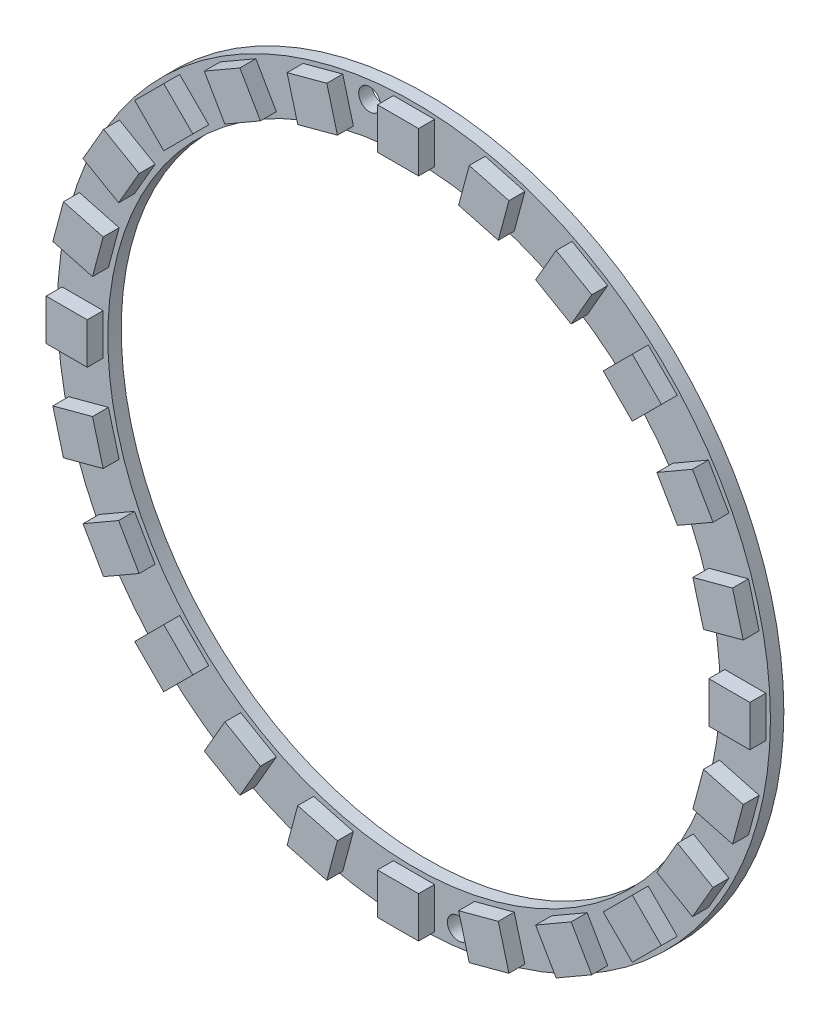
from build123d import *

# Parameters (mm, degrees)
SKIZZE1_R                       = 42.5
SKIZZE1_R_2                     = 36.5
AUFSATZ_LINEAR_AUSTRAGEN1_DEPTH = 1.6
SKIZZE2_W                       = 4.9
SKIZZE2_H                       = 4.9
AUFSATZ_LINEAR_AUSTRAGEN2_DEPTH = 1.9
KREISMUSTER1_COUNT              = 24
DURCHGANGSLOCH_F_R_M21_D        = 2.6


with BuildPart() as part:
    # Skizze1 → Aufsatz-Linear austragen1 (new body)
    with BuildSketch(Plane.XY):
        Circle(SKIZZE1_R)
        Circle(SKIZZE1_R_2, mode=Mode.SUBTRACT)
    extrude(amount=AUFSATZ_LINEAR_AUSTRAGEN1_DEPTH)

    # Skizze2 → Aufsatz-Linear austragen2 (add)
    with BuildSketch(Plane.XY.offset(1.6)):
        with Locations((0, 39.5)):
            Rectangle(SKIZZE2_W, SKIZZE2_H)
    aufsatz_linear_austragen2 = extrude(amount=AUFSATZ_LINEAR_AUSTRAGEN2_DEPTH)

    # Kreismuster1: Aufsatz-Linear austragen2 ×24 about axis
    kreismuster1_axis = Axis((0, 0, 0), (0, 0, 1))
    for i in range(1, KREISMUSTER1_COUNT):
        add(aufsatz_linear_austragen2.rotate(kreismuster1_axis, i * 360 / KREISMUSTER1_COUNT))

    # Durchgangsloch f_r M21 (through all)
    with Locations(Plane.XY.offset(1.6)):
        with Locations((-5.286310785, 40.153516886), (5.286310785, -40.153516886)):
            Hole(DURCHGANGSLOCH_F_R_M21_D / 2)


solid = part.part
